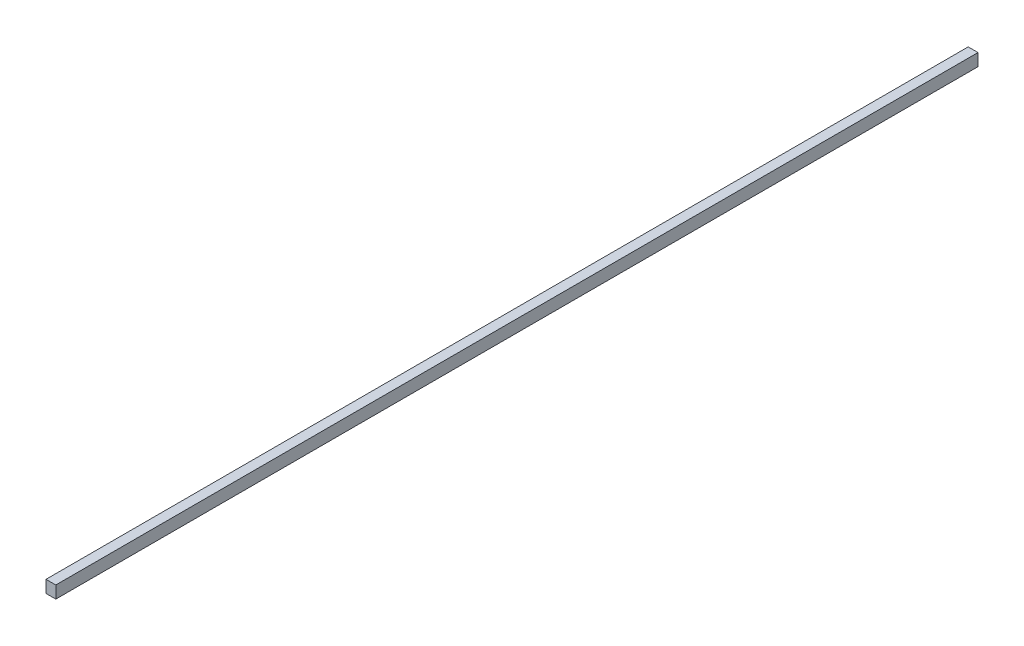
from build123d import *

# Parameters (mm, degrees)
SKETCH1_W           = 12.7
SKETCH1_H           = 15.875
BOSS_EXTRUDE1_DEPTH = 1193.8


with BuildPart() as part:
    # Sketch1 → Boss-Extrude1 (new body)
    with BuildSketch(Plane.XY):
        with Locations((6.35, -7.9375)):
            Rectangle(SKETCH1_W, SKETCH1_H)
    extrude(amount=BOSS_EXTRUDE1_DEPTH)


solid = part.part
